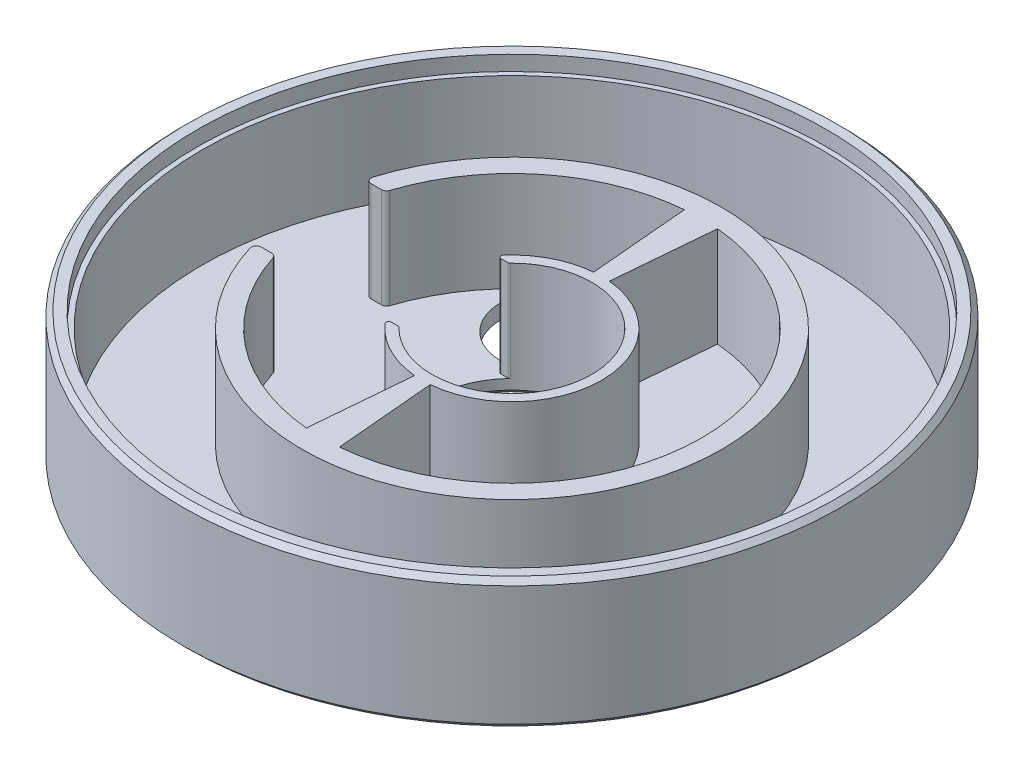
from build123d import *

# Parameters (mm, degrees)
SKETCH1_R           = 33
SKETCH1_R_2         = 20
SKETCH1_R_3         = 8
BOSS_EXTRUDE1_DEPTH = 13
SKETCH2_R           = 31.5
CUT_EXTRUDE1_DEPTH  = 1.5
CUT_REVOLVE3_ANGLE  = 170
CIRPATTERN1_COUNT   = 2
SKETCH6_W           = 11
SKETCH6_H           = 11.5
CUT_EXTRUDE2_DEPTH  = 23
SKETCH7_R           = 5
CUT_EXTRUDE3_DEPTH  = 49.065060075
CHAMFER1_SIZE       = 0.5
CHAMFER2_SIZE       = 0.5
FILLET1_R           = 0.25
FILLET2_R           = 0.25
FILLET3_R           = 0.5


with BuildPart() as part:
    # Sketch1 → Boss-Extrude1 (new body)
    # profile 1 of 2: a face of its own
    with BuildSketch(Plane(origin=(0, 0, 0), x_dir=(1, 0, 0), z_dir=(0, 1, 0))):
        with Locations(Location((0, 0, 0), (0, 0, 270))):
            Circle(SKETCH1_R)
        Circle(SKETCH1_R_2, mode=Mode.SUBTRACT)
    # profile 2 of 2: a face of its own
    with BuildSketch(Plane(origin=(0, 0, 0), x_dir=(1, 0, 0), z_dir=(0, 1, 0))):
        Circle(SKETCH1_R_2)
        with Locations(Location((0, 0, 0), (0, 0, 270))):
            Circle(SKETCH1_R_3, mode=Mode.SUBTRACT)
    extrude(amount=-BOSS_EXTRUDE1_DEPTH)

    # Sketch2 → Cut-Extrude1 (cut)
    with BuildSketch(Plane(origin=(0, 0, 0), x_dir=(1, 0, 0), z_dir=(0, 1, 0))):
        with Locations(Location((0, 0, 0), (0, 0, 270))):
            Circle(SKETCH2_R)
    extrude(amount=-CUT_EXTRUDE1_DEPTH, mode=Mode.SUBTRACT)

    # Sketch4 → Cut-Revolve1 (revolve, cut)
    with BuildSketch(Plane.XY, mode=Mode.PRIVATE) as cut_revolve1_sk:
        Polygon((-26, 0), (-31, 0), (-31, -11.5), (-21, -11.5), (-21, 0), align=None)
    revolve(cut_revolve1_sk.sketch.rotate(Axis((0, -13, 0), (0, 1, 0)), 270), axis=Axis((0, -13, 0), (0, 1, 0)), mode=Mode.SUBTRACT)

    # Sketch5 → Cut-Revolve3 (revolve, symmetric, cut)
    with BuildSketch(Plane.XY) as cut_revolve3_sk:
        Polygon((-14, 0), (-19, 0), (-19, -11.5), (-9, -11.5), (-9, 0), align=None)
    cut_revolve3 = revolve(axis=Axis((0, -13, 0), (0, 1, 0)), revolution_arc=CUT_REVOLVE3_ANGLE / 2, mode=Mode.SUBTRACT)
    cut_revolve3 = cut_revolve3 + revolve(cut_revolve3_sk.sketch, axis=Axis((0, -13, 0), (0, -1, 0)), revolution_arc=CUT_REVOLVE3_ANGLE / 2, mode=Mode.SUBTRACT)

    # CirPattern1: Cut-Revolve3 ×2 about axis
    cirpattern1_axis = Axis((0, 0, 0), (0, 1, 0))
    for i in range(1, CIRPATTERN1_COUNT):
        add(cut_revolve3.rotate(cirpattern1_axis, i * 360 / CIRPATTERN1_COUNT), mode=Mode.SUBTRACT)

    # Sketch6 → Cut-Extrude2 (cut)
    with BuildSketch(Plane(origin=(0, 0, 0), x_dir=(0, 0, -1), z_dir=(1, 0, 0))):
        with Locations((0, -5.75)):
            Rectangle(SKETCH6_W, SKETCH6_H)
    extrude(amount=-CUT_EXTRUDE2_DEPTH, mode=Mode.SUBTRACT)

    # Sketch7 → Cut-Extrude3 (cut, through all)
    with BuildSketch(Plane(origin=(0, -11.5, 0), x_dir=(1, 0, 0), z_dir=(0, 1, 0))):
        with Locations(Location((14, 0, 0), (0, 0, 270))):
            Circle(SKETCH7_R)
        with Locations(Location((-7.784904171, 11.635947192, 0), (0, 0, 270))):
            Circle(SKETCH7_R)
    extrude(amount=-CUT_EXTRUDE3_DEPTH, mode=Mode.SUBTRACT)

    # Chamfer1
    chamfer1_edges = [part.edges().sort_by_distance(p)[0] for p in [
        (0, -13, -33),
        (0, 0, -33),
    ]]
    chamfer(chamfer1_edges, length=CHAMFER1_SIZE)

    # Chamfer2
    chamfer2_edges = [part.edges().sort_by_distance(p)[0] for p in [
        (0, -13, -8),
    ]]
    chamfer(chamfer2_edges, length=CHAMFER2_SIZE)

    # Fillet1
    fillet1_edges = [part.edges().sort_by_distance(p)[0] for p in [
        (-7.123903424, -6.5, -5.5),
        (-5.809475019, -6.5, -5.5),
    ]]
    fillet(fillet1_edges, radius=FILLET1_R)

    # Fillet2
    fillet2_edges = [part.edges().sort_by_distance(p)[0] for p in [
        (-7.123903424, -6.5, 5.5),
        (-5.809475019, -6.5, 5.5),
    ]]
    fillet(fillet2_edges, radius=FILLET2_R)

    # Fillet3
    fillet3_edges = [part.edges().sort_by_distance(p)[0] for p in [
        (-20.2669682, -6.5, 5.5),
        (-20.2669682, -6.5, -5.5),
        (-18.186533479, -6.5, 5.5),
        (-18.186533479, -6.5, -5.5),
    ]]
    fillet(fillet3_edges, radius=FILLET3_R)


solid = part.part
